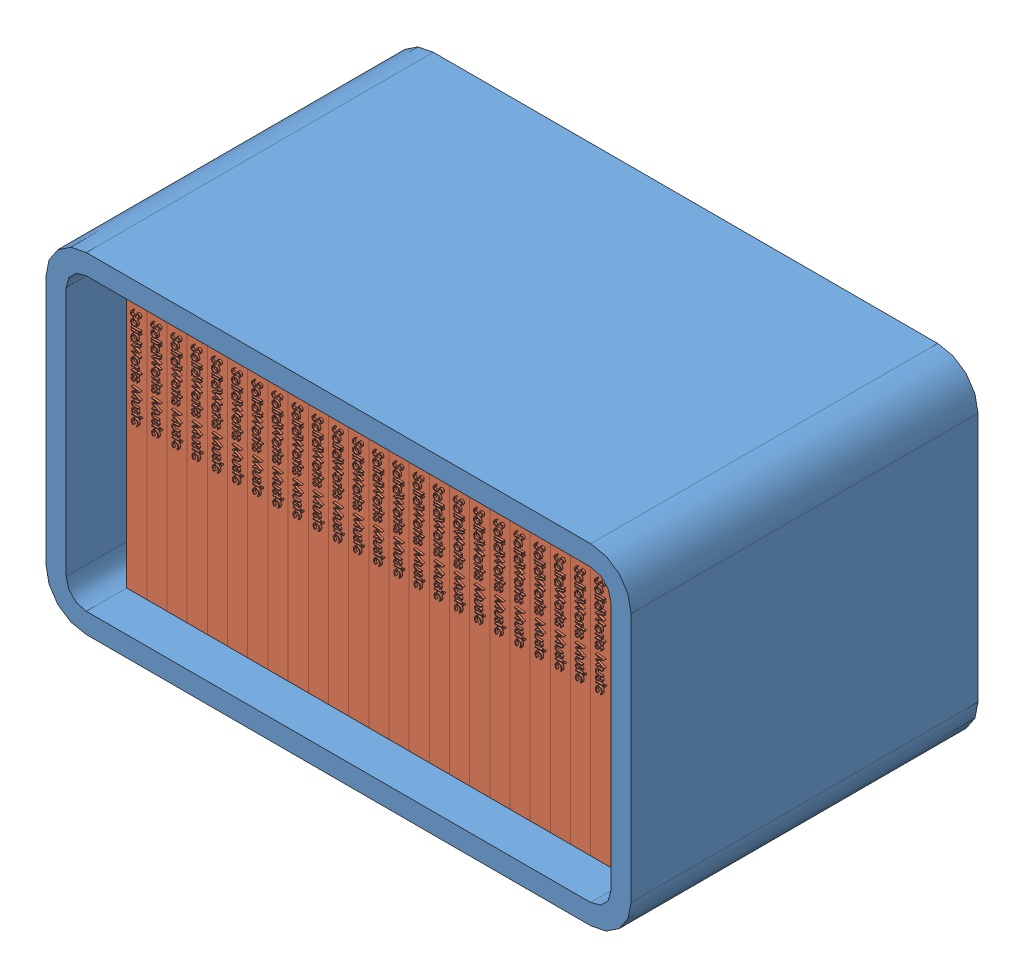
SolidWorks assembly cdcase-storagebox.SLDASM, configuration Default (file format 8000). Lengths in mm.
Overall size (290 164 172).
26 component instances, 2 part files, 3 mates.
Components (placement in the parent):
- storagebox-1: storagebox.SLDPRT [Default] at origin size (290 164 172)
- cdcase-1: cdcase.SLDPRT [Default] at (20 10 -20) size (10 124 143)
- cdcase-2: cdcase.SLDPRT [Default] at (30 10 -20) size (10 124 143)
- cdcase-3: cdcase.SLDPRT [Default] at (40 10 -20) size (10 124 143)
- cdcase-4: cdcase.SLDPRT [Default] at (50 10 -20) size (10 124 143)
- cdcase-5: cdcase.SLDPRT [Default] at (60 10 -20) size (10 124 143)
- cdcase-6: cdcase.SLDPRT [Default] at (70 10 -20) size (10 124 143)
- cdcase-7: cdcase.SLDPRT [Default] at (80 10 -20) size (10 124 143)
- cdcase-8: cdcase.SLDPRT [Default] at (90 10 -20) size (10 124 143)
- cdcase-9: cdcase.SLDPRT [Default] at (100 10 -20) size (10 124 143)
- cdcase-10: cdcase.SLDPRT [Default] at (110 10 -20) size (10 124 143)
- cdcase-11: cdcase.SLDPRT [Default] at (120 10 -20) size (10 124 143)
- cdcase-12: cdcase.SLDPRT [Default] at (130 10 -20) size (10 124 143)
- cdcase-13: cdcase.SLDPRT [Default] at (140 10 -20) size (10 124 143)
- cdcase-14: cdcase.SLDPRT [Default] at (150 10 -20) size (10 124 143)
- cdcase-15: cdcase.SLDPRT [Default] at (160 10 -20) size (10 124 143)
- cdcase-16: cdcase.SLDPRT [Default] at (170 10 -20) size (10 124 143)
- cdcase-17: cdcase.SLDPRT [Default] at (180 10 -20) size (10 124 143)
- cdcase-18: cdcase.SLDPRT [Default] at (190 10 -20) size (10 124 143)
- cdcase-19: cdcase.SLDPRT [Default] at (200 10 -20) size (10 124 143)
- cdcase-20: cdcase.SLDPRT [Default] at (210 10 -20) size (10 124 143)
- cdcase-21: cdcase.SLDPRT [Default] at (220 10 -20) size (10 124 143)
- cdcase-22: cdcase.SLDPRT [Default] at (230 10 -20) size (10 124 143)
- cdcase-23: cdcase.SLDPRT [Default] at (240 10 -20) size (10 124 143)
- cdcase-24: cdcase.SLDPRT [Default] at (250 10 -20) size (10 124 143)
- cdcase-25: cdcase.SLDPRT [Default] at (260 10 -20) size (10 124 143)
Mates (geometry in assembly coordinates):
- Coincident3: coincident anti-aligned: plane of storagebox-1 through (0 10 -172) normal (0 1 0); plane of cdcase-1 through (30 10 -20) normal (0 -1 0)
- Coincident4: coincident anti-aligned: plane of storagebox-1 through (0 164 -162) normal (0 0 1); plane of cdcase-1 through (30 10 -162) normal (0 0 -1)
- Distance1: distance = 10 mm anti-aligned: plane of storagebox-1 through (10 0 -172) normal (1 0 0); plane of cdcase-1 through (20 134 -20) normal (-1 0 0)
